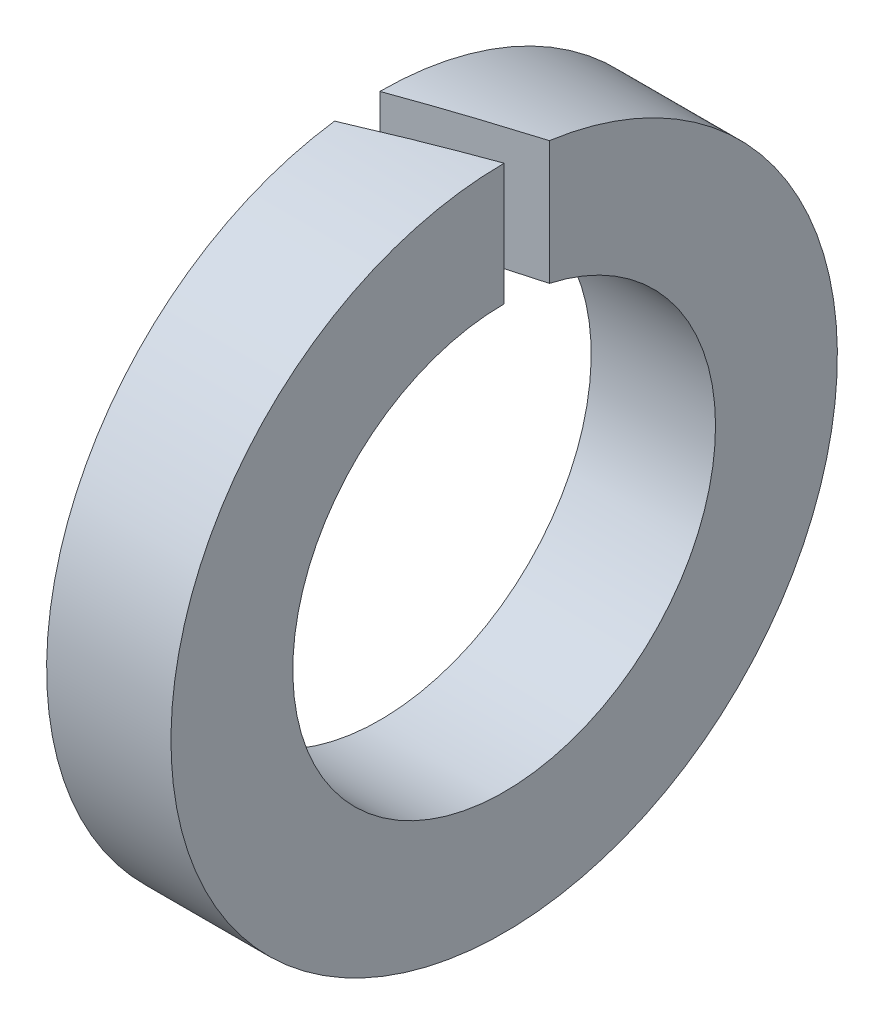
ISO-10303-21;
HEADER;
FILE_DESCRIPTION(('STEP AP214'),'2;1');
FILE_NAME('part.step','',(''),(''),'','','');
FILE_SCHEMA(('AUTOMOTIVE_DESIGN { 1 0 10303 214 1 1 1 1 }'));
ENDSEC;
DATA;
#1=APPLICATION_CONTEXT('core data for automotive mechanical design processes');
#2=APPLICATION_PROTOCOL_DEFINITION('international standard','automotive_design',2000,#1);
#3=PRODUCT_CONTEXT('',#1,'mechanical');
#4=PRODUCT('Part','Part','',(#3));
#5=PRODUCT_RELATED_PRODUCT_CATEGORY('part','',(#4));
#6=PRODUCT_DEFINITION_FORMATION('','',#4);
#7=PRODUCT_DEFINITION_CONTEXT('part definition',#1,'design');
#8=PRODUCT_DEFINITION('design','',#6,#7);
#9=PRODUCT_DEFINITION_SHAPE('','',#8);
#10=(LENGTH_UNIT() NAMED_UNIT(*) SI_UNIT(.MILLI.,.METRE.));
#11=(NAMED_UNIT(*) PLANE_ANGLE_UNIT() SI_UNIT($,.RADIAN.));
#12=(NAMED_UNIT(*) SI_UNIT($,.STERADIAN.) SOLID_ANGLE_UNIT());
#13=UNCERTAINTY_MEASURE_WITH_UNIT(LENGTH_MEASURE(1.E-05),#10,'distance_accuracy_value','');
#14=(GEOMETRIC_REPRESENTATION_CONTEXT(3) GLOBAL_UNCERTAINTY_ASSIGNED_CONTEXT((#13)) GLOBAL_UNIT_ASSIGNED_CONTEXT((#10,
#11,#12)) REPRESENTATION_CONTEXT('',''));
#15=CARTESIAN_POINT('',(0.,0.,0.));
#16=DIRECTION('',(0.,0.,1.));
#17=DIRECTION('',(1.,0.,0.));
#18=AXIS2_PLACEMENT_3D('',#15,#16,#17);
#19=CARTESIAN_POINT('',(0.,0.,-6.7));
#20=DIRECTION('',(1.,0.,0.));
#21=DIRECTION('',(0.,0.,-1.));
#22=AXIS2_PLACEMENT_3D('',#19,#20,#21);
#23=PLANE('',#22);
#24=DIRECTION('',(0.,-1.,0.));
#25=VECTOR('',#24,1.);
#26=CARTESIAN_POINT('',(0.,6.7,0.909925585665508));
#27=LINE('',#26,#25);
#28=CARTESIAN_POINT('',(0.,6.63792403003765,0.909925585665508));
#29=VERTEX_POINT('',#28);
#30=CARTESIAN_POINT('',(0.,4.15144979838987,0.909925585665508));
#31=VERTEX_POINT('',#30);
#32=EDGE_CURVE('E52',#29,#31,#27,.T.);
#33=ORIENTED_EDGE('',*,*,#32,.T.);
#34=CARTESIAN_POINT('',(0.,0.,0.));
#35=DIRECTION('',(-1.,0.,0.));
#36=DIRECTION('',(0.,0.,1.));
#37=AXIS2_PLACEMENT_3D('',#34,#35,#36);
#38=CIRCLE('',#37,4.25);
#39=CARTESIAN_POINT('',(0.,4.25,0.));
#40=VERTEX_POINT('',#39);
#41=EDGE_CURVE('E86',#40,#31,#38,.T.);
#42=ORIENTED_EDGE('',*,*,#41,.F.);
#43=DIRECTION('',(0.,-1.,0.));
#44=VECTOR('',#43,1.);
#45=CARTESIAN_POINT('',(0.,6.7,0.));
#46=LINE('',#45,#44);
#47=CARTESIAN_POINT('',(0.,6.7,0.));
#48=VERTEX_POINT('',#47);
#49=EDGE_CURVE('E95',#48,#40,#46,.T.);
#50=ORIENTED_EDGE('',*,*,#49,.F.);
#51=CARTESIAN_POINT('',(0.,0.,0.));
#52=DIRECTION('',(-1.,0.,0.));
#53=DIRECTION('',(0.,0.,1.));
#54=AXIS2_PLACEMENT_3D('',#51,#52,#53);
#55=CIRCLE('',#54,6.7);
#56=EDGE_CURVE('E84',#48,#29,#55,.T.);
#57=ORIENTED_EDGE('',*,*,#56,.T.);
#58=EDGE_LOOP('',(#33,#42,#50,#57));
#59=FACE_BOUND('',#58,.T.);
#60=ADVANCED_FACE('F31',(#59),#23,.F.);
#61=CARTESIAN_POINT('',(0.,0.,0.));
#62=DIRECTION('',(-1.,0.,0.));
#63=DIRECTION('',(0.,0.,1.));
#64=AXIS2_PLACEMENT_3D('',#61,#62,#63);
#65=CYLINDRICAL_SURFACE('',#64,4.25);
#66=CARTESIAN_POINT('',(2.5,0.,0.));
#67=DIRECTION('',(-0.342020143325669,0.,-0.939692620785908));
#68=DIRECTION('',(-0.939692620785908,0.,0.342020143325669));
#69=AXIS2_PLACEMENT_3D('',#66,#67,#68);
#70=ELLIPSE('',#69,12.4261687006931,4.25);
#71=CARTESIAN_POINT('',(2.5,4.25,0.));
#72=VERTEX_POINT('',#71);
#73=EDGE_CURVE('E88',#72,#31,#70,.F.);
#74=ORIENTED_EDGE('',*,*,#73,.F.);
#75=CARTESIAN_POINT('',(2.5,0.,0.));
#76=DIRECTION('',(-1.,0.,0.));
#77=DIRECTION('',(0.,0.,1.));
#78=AXIS2_PLACEMENT_3D('',#75,#76,#77);
#79=CIRCLE('',#78,4.25);
#80=CARTESIAN_POINT('',(2.5,4.15144979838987,-0.909925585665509));
#81=VERTEX_POINT('',#80);
#82=EDGE_CURVE('E81',#81,#72,#79,.T.);
#83=ORIENTED_EDGE('',*,*,#82,.F.);
#84=CARTESIAN_POINT('',(0.,0.,0.));
#85=DIRECTION('',(0.34202014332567,0.,0.939692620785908));
#86=DIRECTION('',(-0.939692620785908,0.,0.34202014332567));
#87=AXIS2_PLACEMENT_3D('',#84,#85,#86);
#88=ELLIPSE('',#87,12.4261687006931,4.25);
#89=EDGE_CURVE('E103',#40,#81,#88,.F.);
#90=ORIENTED_EDGE('',*,*,#89,.F.);
#91=ORIENTED_EDGE('',*,*,#41,.T.);
#92=EDGE_LOOP('',(#74,#83,#90,#91));
#93=FACE_BOUND('',#92,.T.);
#94=ADVANCED_FACE('F105',(#93),#65,.F.);
#95=CARTESIAN_POINT('',(2.5,0.,-6.7));
#96=DIRECTION('',(-1.,0.,0.));
#97=DIRECTION('',(0.,0.,1.));
#98=AXIS2_PLACEMENT_3D('',#95,#96,#97);
#99=PLANE('',#98);
#100=DIRECTION('',(0.,-1.,0.));
#101=VECTOR('',#100,1.);
#102=CARTESIAN_POINT('',(2.5,6.7,0.));
#103=LINE('',#102,#101);
#104=CARTESIAN_POINT('',(2.5,6.7,0.));
#105=VERTEX_POINT('',#104);
#106=EDGE_CURVE('E69',#105,#72,#103,.T.);
#107=ORIENTED_EDGE('',*,*,#106,.F.);
#108=CARTESIAN_POINT('',(2.5,0.,0.));
#109=DIRECTION('',(-1.,0.,0.));
#110=DIRECTION('',(0.,0.,1.));
#111=AXIS2_PLACEMENT_3D('',#108,#109,#110);
#112=CIRCLE('',#111,6.7);
#113=CARTESIAN_POINT('',(2.5,6.63792403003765,-0.909925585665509));
#114=VERTEX_POINT('',#113);
#115=EDGE_CURVE('E79',#114,#105,#112,.T.);
#116=ORIENTED_EDGE('',*,*,#115,.F.);
#117=DIRECTION('',(0.,-1.,0.));
#118=VECTOR('',#117,1.);
#119=CARTESIAN_POINT('',(2.5,6.7,-0.909925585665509));
#120=LINE('',#119,#118);
#121=EDGE_CURVE('E45',#114,#81,#120,.T.);
#122=ORIENTED_EDGE('',*,*,#121,.T.);
#123=ORIENTED_EDGE('',*,*,#82,.T.);
#124=EDGE_LOOP('',(#107,#116,#122,#123));
#125=FACE_BOUND('',#124,.T.);
#126=ADVANCED_FACE('F78',(#125),#99,.F.);
#127=CARTESIAN_POINT('',(0.,0.,0.));
#128=DIRECTION('',(-1.,0.,0.));
#129=DIRECTION('',(0.,0.,1.));
#130=AXIS2_PLACEMENT_3D('',#127,#128,#129);
#131=CYLINDRICAL_SURFACE('',#130,6.7);
#132=CARTESIAN_POINT('',(2.5,0.,0.));
#133=DIRECTION('',(-0.342020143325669,0.,-0.939692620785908));
#134=DIRECTION('',(-0.939692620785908,0.,0.342020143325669));
#135=AXIS2_PLACEMENT_3D('',#132,#133,#134);
#136=ELLIPSE('',#135,19.5894894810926,6.7);
#137=EDGE_CURVE('E11',#29,#105,#136,.T.);
#138=ORIENTED_EDGE('',*,*,#137,.F.);
#139=ORIENTED_EDGE('',*,*,#56,.F.);
#140=CARTESIAN_POINT('',(0.,0.,0.));
#141=DIRECTION('',(0.34202014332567,0.,0.939692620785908));
#142=DIRECTION('',(-0.939692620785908,0.,0.34202014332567));
#143=AXIS2_PLACEMENT_3D('',#140,#141,#142);
#144=ELLIPSE('',#143,19.5894894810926,6.7);
#145=EDGE_CURVE('E38',#114,#48,#144,.T.);
#146=ORIENTED_EDGE('',*,*,#145,.F.);
#147=ORIENTED_EDGE('',*,*,#115,.T.);
#148=EDGE_LOOP('',(#138,#139,#146,#147));
#149=FACE_BOUND('',#148,.T.);
#150=ADVANCED_FACE('F83',(#149),#131,.T.);
#151=CARTESIAN_POINT('',(0.,6.7,0.));
#152=DIRECTION('',(0.34202014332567,0.,0.939692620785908));
#153=DIRECTION('',(0.939692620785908,0.,-0.34202014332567));
#154=AXIS2_PLACEMENT_3D('',#151,#152,#153);
#155=PLANE('',#154);
#156=ORIENTED_EDGE('',*,*,#89,.T.);
#157=ORIENTED_EDGE('',*,*,#121,.F.);
#158=ORIENTED_EDGE('',*,*,#145,.T.);
#159=ORIENTED_EDGE('',*,*,#49,.T.);
#160=EDGE_LOOP('',(#156,#157,#158,#159));
#161=FACE_BOUND('',#160,.T.);
#162=ADVANCED_FACE('F94',(#161),#155,.T.);
#163=CARTESIAN_POINT('',(2.5,6.7,0.));
#164=DIRECTION('',(-0.342020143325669,0.,-0.939692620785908));
#165=DIRECTION('',(-0.939692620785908,0.,0.342020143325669));
#166=AXIS2_PLACEMENT_3D('',#163,#164,#165);
#167=PLANE('',#166);
#168=ORIENTED_EDGE('',*,*,#73,.T.);
#169=ORIENTED_EDGE('',*,*,#32,.F.);
#170=ORIENTED_EDGE('',*,*,#137,.T.);
#171=ORIENTED_EDGE('',*,*,#106,.T.);
#172=EDGE_LOOP('',(#168,#169,#170,#171));
#173=FACE_BOUND('',#172,.T.);
#174=ADVANCED_FACE('F68',(#173),#167,.T.);
#175=CLOSED_SHELL('',(#60,#94,#126,#150,#162,#174));
#176=MANIFOLD_SOLID_BREP('B2',#175);
#177=ADVANCED_BREP_SHAPE_REPRESENTATION('',(#18,#176),#14);
#178=SHAPE_DEFINITION_REPRESENTATION(#9,#177);
ENDSEC;
END-ISO-10303-21;
